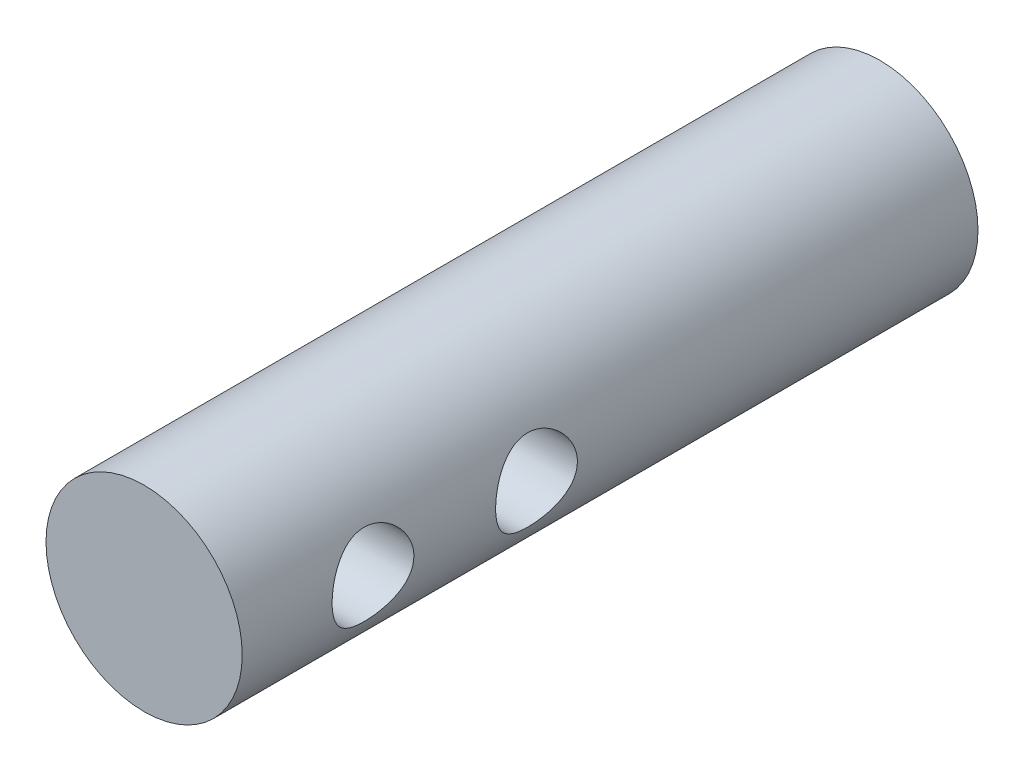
ISO-10303-21;
HEADER;
FILE_DESCRIPTION(('STEP AP214'),'2;1');
FILE_NAME('part.step','',(''),(''),'','','');
FILE_SCHEMA(('AUTOMOTIVE_DESIGN { 1 0 10303 214 1 1 1 1 }'));
ENDSEC;
DATA;
#1=APPLICATION_CONTEXT('core data for automotive mechanical design processes');
#2=APPLICATION_PROTOCOL_DEFINITION('international standard','automotive_design',2000,#1);
#3=PRODUCT_CONTEXT('',#1,'mechanical');
#4=PRODUCT('Part','Part','',(#3));
#5=PRODUCT_RELATED_PRODUCT_CATEGORY('part','',(#4));
#6=PRODUCT_DEFINITION_FORMATION('','',#4);
#7=PRODUCT_DEFINITION_CONTEXT('part definition',#1,'design');
#8=PRODUCT_DEFINITION('design','',#6,#7);
#9=PRODUCT_DEFINITION_SHAPE('','',#8);
#10=(LENGTH_UNIT() NAMED_UNIT(*) SI_UNIT(.MILLI.,.METRE.));
#11=(NAMED_UNIT(*) PLANE_ANGLE_UNIT() SI_UNIT($,.RADIAN.));
#12=(NAMED_UNIT(*) SI_UNIT($,.STERADIAN.) SOLID_ANGLE_UNIT());
#13=UNCERTAINTY_MEASURE_WITH_UNIT(LENGTH_MEASURE(1.E-05),#10,'distance_accuracy_value','');
#14=(GEOMETRIC_REPRESENTATION_CONTEXT(3) GLOBAL_UNCERTAINTY_ASSIGNED_CONTEXT((#13)) GLOBAL_UNIT_ASSIGNED_CONTEXT((#10,
#11,#12)) REPRESENTATION_CONTEXT('',''));
#15=CARTESIAN_POINT('',(0.,0.,0.));
#16=DIRECTION('',(0.,0.,1.));
#17=DIRECTION('',(1.,0.,0.));
#18=AXIS2_PLACEMENT_3D('',#15,#16,#17);
#19=CARTESIAN_POINT('',(0.,0.,21.));
#20=DIRECTION('',(0.,0.,1.));
#21=DIRECTION('',(1.,0.,0.));
#22=AXIS2_PLACEMENT_3D('',#19,#20,#21);
#23=PLANE('',#22);
#24=CARTESIAN_POINT('',(0.,0.,21.));
#25=DIRECTION('',(0.,0.,1.));
#26=DIRECTION('',(1.,0.,0.));
#27=AXIS2_PLACEMENT_3D('',#24,#25,#26);
#28=CIRCLE('',#27,4.05);
#29=CARTESIAN_POINT('',(4.05,0.,21.));
#30=VERTEX_POINT('',#29);
#31=EDGE_CURVE('E17',#30,#30,#28,.F.);
#32=ORIENTED_EDGE('',*,*,#31,.T.);
#33=EDGE_LOOP('',(#32));
#34=FACE_BOUND('',#33,.T.);
#35=ADVANCED_FACE('F14',(#34),#23,.F.);
#36=CARTESIAN_POINT('',(0.,0.,0.));
#37=DIRECTION('',(0.,0.,1.));
#38=DIRECTION('',(1.,0.,0.));
#39=AXIS2_PLACEMENT_3D('',#36,#37,#38);
#40=CYLINDRICAL_SURFACE('',#39,4.05);
#41=CARTESIAN_POINT('',(0.,0.,0.));
#42=DIRECTION('',(0.,0.,1.));
#43=DIRECTION('',(1.,0.,0.));
#44=AXIS2_PLACEMENT_3D('',#41,#42,#43);
#45=CIRCLE('',#44,4.05);
#46=CARTESIAN_POINT('',(4.05,0.,0.));
#47=VERTEX_POINT('',#46);
#48=EDGE_CURVE('E78',#47,#47,#45,.T.);
#49=ORIENTED_EDGE('',*,*,#48,.F.);
#50=EDGE_LOOP('',(#49));
#51=FACE_BOUND('',#50,.T.);
#52=ORIENTED_EDGE('',*,*,#31,.F.);
#53=EDGE_LOOP('',(#52));
#54=FACE_BOUND('',#53,.T.);
#55=ADVANCED_FACE('F66',(#51,#54),#40,.F.);
#56=CARTESIAN_POINT('',(0.,0.,45.));
#57=DIRECTION('',(0.,0.,-1.));
#58=DIRECTION('',(-1.,0.,0.));
#59=AXIS2_PLACEMENT_3D('',#56,#57,#58);
#60=PLANE('',#59);
#61=CARTESIAN_POINT('',(0.,0.,45.));
#62=DIRECTION('',(0.,0.,1.));
#63=DIRECTION('',(1.,0.,0.));
#64=AXIS2_PLACEMENT_3D('',#61,#62,#63);
#65=CIRCLE('',#64,6.);
#66=CARTESIAN_POINT('',(6.,0.,45.));
#67=VERTEX_POINT('',#66);
#68=EDGE_CURVE('E81',#67,#67,#65,.F.);
#69=ORIENTED_EDGE('',*,*,#68,.F.);
#70=EDGE_LOOP('',(#69));
#71=FACE_BOUND('',#70,.T.);
#72=ADVANCED_FACE('F62',(#71),#60,.F.);
#73=CARTESIAN_POINT('',(0.,0.,27.));
#74=DIRECTION('',(1.,0.,0.));
#75=DIRECTION('',(0.,0.,-1.));
#76=AXIS2_PLACEMENT_3D('',#73,#74,#75);
#77=CYLINDRICAL_SURFACE('',#76,2.5);
#78=CARTESIAN_POINT('',(-5.45435605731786,2.5,27.));
#79=CARTESIAN_POINT('',(-5.45435734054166,2.49999850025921,27.0667081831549));
#80=CARTESIAN_POINT('',(-5.4555854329,2.49732449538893,27.1334347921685));
#81=CARTESIAN_POINT('',(-5.460451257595,2.48666416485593,27.266386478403));
#82=CARTESIAN_POINT('',(-5.46409042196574,2.47867468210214,27.3326112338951));
#83=CARTESIAN_POINT('',(-5.47848490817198,2.44679265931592,27.5300518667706));
#84=CARTESIAN_POINT('',(-5.49271671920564,2.41498683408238,27.6598368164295));
#85=CARTESIAN_POINT('',(-5.52853615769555,2.33180001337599,27.9111547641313));
#86=CARTESIAN_POINT('',(-5.55009376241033,2.28049881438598,28.0327190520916));
#87=CARTESIAN_POINT('',(-5.59808356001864,2.16001268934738,28.265510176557));
#88=CARTESIAN_POINT('',(-5.62451459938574,2.09083199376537,28.3767394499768));
#89=CARTESIAN_POINT('',(-5.68111508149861,1.93194778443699,28.5926539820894));
#90=CARTESIAN_POINT('',(-5.71141131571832,1.84130648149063,28.6966157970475));
#91=CARTESIAN_POINT('',(-5.77128595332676,1.64404334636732,28.8883997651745));
#92=CARTESIAN_POINT('',(-5.80086407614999,1.53741538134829,28.9762156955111));
#93=CARTESIAN_POINT('',(-5.8575107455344,1.30552678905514,29.1368992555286));
#94=CARTESIAN_POINT('',(-5.88441479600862,1.17965858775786,29.2089533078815));
#95=CARTESIAN_POINT('',(-5.93113040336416,0.916264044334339,29.3305519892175));
#96=CARTESIAN_POINT('',(-5.95094510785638,0.778742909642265,29.3801066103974));
#97=CARTESIAN_POINT('',(-5.98035041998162,0.503536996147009,29.4526789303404));
#98=CARTESIAN_POINT('',(-5.99041942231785,0.36623315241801,29.4769433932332));
#99=CARTESIAN_POINT('',(-6.00093657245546,0.0891583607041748,29.502275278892));
#100=CARTESIAN_POINT('',(-6.00138862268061,-0.0506115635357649,29.5033521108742));
#101=CARTESIAN_POINT('',(-5.99290258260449,-0.319585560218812,29.4829314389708));
#102=CARTESIAN_POINT('',(-5.98453429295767,-0.448914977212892,29.4628037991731));
#103=CARTESIAN_POINT('',(-5.96013033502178,-0.702165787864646,29.4028937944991));
#104=CARTESIAN_POINT('',(-5.94409410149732,-0.826086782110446,29.3631099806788));
#105=CARTESIAN_POINT('',(-5.90559704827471,-1.06727623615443,29.2645439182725));
#106=CARTESIAN_POINT('',(-5.88304194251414,-1.18441435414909,29.2054810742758));
#107=CARTESIAN_POINT('',(-5.83371427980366,-1.40742353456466,29.0703084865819));
#108=CARTESIAN_POINT('',(-5.80694023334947,-1.51329059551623,28.9941927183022));
#109=CARTESIAN_POINT('',(-5.74963397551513,-1.7186818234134,28.8208351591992));
#110=CARTESIAN_POINT('',(-5.71896988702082,-1.81723287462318,28.722482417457));
#111=CARTESIAN_POINT('',(-5.65875721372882,-1.99686282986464,28.5105771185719));
#112=CARTESIAN_POINT('',(-5.62920906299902,-2.0779349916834,28.3970187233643));
#113=CARTESIAN_POINT('',(-5.57363224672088,-2.22280378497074,28.1532099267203));
#114=CARTESIAN_POINT('',(-5.54775116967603,-2.28594506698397,28.0225335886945));
#115=CARTESIAN_POINT('',(-5.50419688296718,-2.38892864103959,27.7510379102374));
#116=CARTESIAN_POINT('',(-5.48651780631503,-2.42878759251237,27.6102259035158));
#117=CARTESIAN_POINT('',(-5.46282425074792,-2.48160050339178,27.332206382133));
#118=CARTESIAN_POINT('',(-5.45612738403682,-2.49613229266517,27.1953577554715));
#119=CARTESIAN_POINT('',(-5.45320573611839,-2.50251261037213,26.9210430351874));
#120=CARTESIAN_POINT('',(-5.45697733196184,-2.49436898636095,26.7835771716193));
#121=CARTESIAN_POINT('',(-5.47386262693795,-2.45706955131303,26.5212032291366));
#122=CARTESIAN_POINT('',(-5.48636276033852,-2.42929237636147,26.3960546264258));
#123=CARTESIAN_POINT('',(-5.51851260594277,-2.355341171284,26.1522974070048));
#124=CARTESIAN_POINT('',(-5.53816398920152,-2.30916284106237,26.0336903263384));
#125=CARTESIAN_POINT('',(-5.58341595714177,-2.19755041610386,25.8007693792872));
#126=CARTESIAN_POINT('',(-5.60923324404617,-2.13138366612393,25.6868500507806));
#127=CARTESIAN_POINT('',(-5.66360007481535,-1.98240156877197,25.4711838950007));
#128=CARTESIAN_POINT('',(-5.69215079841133,-1.89957901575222,25.3694423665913));
#129=CARTESIAN_POINT('',(-5.75157239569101,-1.71168891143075,25.1723997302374));
#130=CARTESIAN_POINT('',(-5.78244293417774,-1.6053593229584,25.0782972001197));
#131=CARTESIAN_POINT('',(-5.84086722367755,-1.37770302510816,24.9090554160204));
#132=CARTESIAN_POINT('',(-5.868420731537,-1.25637521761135,24.8339175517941));
#133=CARTESIAN_POINT('',(-5.91728503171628,-1.00130936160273,24.7048202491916));
#134=CARTESIAN_POINT('',(-5.93857966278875,-0.867540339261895,24.6509155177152));
#135=CARTESIAN_POINT('',(-5.9723634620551,-0.591717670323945,24.5667664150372));
#136=CARTESIAN_POINT('',(-5.98485787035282,-0.449669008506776,24.536507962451));
#137=CARTESIAN_POINT('',(-5.9990306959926,-0.172033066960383,24.5022837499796));
#138=CARTESIAN_POINT('',(-6.0014040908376,-0.0366881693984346,24.4966280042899));
#139=CARTESIAN_POINT('',(-5.99699046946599,0.232973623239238,24.5072262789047));
#140=CARTESIAN_POINT('',(-5.99020505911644,0.367290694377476,24.523476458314));
#141=CARTESIAN_POINT('',(-5.9686013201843,0.626172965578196,24.5762121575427));
#142=CARTESIAN_POINT('',(-5.95407648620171,0.750915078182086,24.6119594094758));
#143=CARTESIAN_POINT('',(-5.91858999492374,0.992584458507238,24.7018684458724));
#144=CARTESIAN_POINT('',(-5.8976271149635,1.1095102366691,24.7560337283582));
#145=CARTESIAN_POINT('',(-5.85011651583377,1.33804914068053,24.8839792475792));
#146=CARTESIAN_POINT('',(-5.82335921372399,1.44918335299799,24.958535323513));
#147=CARTESIAN_POINT('',(-5.7674312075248,1.65783731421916,25.1240136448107));
#148=CARTESIAN_POINT('',(-5.73825960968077,1.75535198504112,25.2149419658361));
#149=CARTESIAN_POINT('',(-5.67829702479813,1.9408997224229,25.4178925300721));
#150=CARTESIAN_POINT('',(-5.64753091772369,2.02783607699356,25.5309291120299));
#151=CARTESIAN_POINT('',(-5.5899105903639,2.18166607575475,25.7709063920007));
#152=CARTESIAN_POINT('',(-5.56305856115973,2.24854851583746,25.8978548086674));
#153=CARTESIAN_POINT('',(-5.51685287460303,2.35965744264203,26.1619289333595));
#154=CARTESIAN_POINT('',(-5.49745949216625,2.40400437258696,26.2989959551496));
#155=CARTESIAN_POINT('',(-5.47594959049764,2.45239925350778,26.5091637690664));
#156=CARTESIAN_POINT('',(-5.47004503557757,2.46550603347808,26.5799105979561));
#157=CARTESIAN_POINT('',(-5.46095373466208,2.48558130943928,26.7224260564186));
#158=CARTESIAN_POINT('',(-5.45776506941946,2.49255414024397,26.7941939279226));
#159=CARTESIAN_POINT('',(-5.45490391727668,2.49880479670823,26.910711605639));
#160=CARTESIAN_POINT('',(-5.45435519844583,2.50000100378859,26.9553516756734));
#161=CARTESIAN_POINT('',(-5.45435605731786,2.5,27.));
#162=B_SPLINE_CURVE_WITH_KNOTS('',3,(#78,#79,#80,#81,#82,#83,#84,#85,#86,#87,#88,#89,#90,#91,
#92,#93,#94,#95,#96,#97,#98,#99,#100,#101,#102,#103,#104,#105,#106,#107,#108,#109,#110,#111,
#112,#113,#114,#115,#116,#117,#118,#119,#120,#121,#122,#123,#124,#125,#126,#127,#128,#129,#130,
#131,#132,#133,#134,#135,#136,#137,#138,#139,#140,#141,#142,#143,#144,#145,#146,#147,#148,#149,
#150,#151,#152,#153,#154,#155,#156,#157,#158,#159,#160,#161),.UNSPECIFIED.,.T.,.F.,(4,2,2,2,2,2,
2,2,2,2,2,2,2,2,2,2,2,2,2,2,2,2,2,2,2,2,2,2,2,2,2,2,2,2,2,2,2,2,2,2,2,4),(0.,0.200084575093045,
0.400288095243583,0.801278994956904,1.20064597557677,1.59991854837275,2.02172149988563,
2.44368668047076,2.88395420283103,3.32402600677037,3.7411967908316,4.15819828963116,
4.54982147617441,4.94147353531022,5.33910096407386,5.73686909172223,6.16267530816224,
6.58864548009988,7.02861558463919,7.46827048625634,7.87940023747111,8.29038772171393,
8.6750626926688,9.05982760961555,9.46088720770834,9.86212068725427,10.2960179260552,
10.7299469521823,11.1649867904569,11.5997673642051,12.004157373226,12.4084764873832,
12.7984529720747,13.1885035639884,13.5961819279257,14.0040118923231,14.4395932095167,
14.8754174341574,15.3088871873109,15.5252058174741,15.7413714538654,15.8752896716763),.UNSPECIFIED.);
#163=CARTESIAN_POINT('',(-5.45435605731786,2.5,27.));
#164=VERTEX_POINT('',#163);
#165=EDGE_CURVE('E54',#164,#164,#162,.T.);
#166=ORIENTED_EDGE('',*,*,#165,.F.);
#167=EDGE_LOOP('',(#166));
#168=FACE_BOUND('',#167,.T.);
#169=CARTESIAN_POINT('',(5.45435605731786,2.5,27.));
#170=CARTESIAN_POINT('',(5.45435734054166,2.49999850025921,26.9332918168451));
#171=CARTESIAN_POINT('',(5.4555854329,2.49732449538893,26.8665652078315));
#172=CARTESIAN_POINT('',(5.460451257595,2.48666416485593,26.733613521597));
#173=CARTESIAN_POINT('',(5.46409042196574,2.47867468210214,26.6673887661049));
#174=CARTESIAN_POINT('',(5.47848490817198,2.44679265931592,26.4699481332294));
#175=CARTESIAN_POINT('',(5.49271671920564,2.41498683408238,26.3401631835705));
#176=CARTESIAN_POINT('',(5.52853615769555,2.33180001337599,26.0888452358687));
#177=CARTESIAN_POINT('',(5.55009376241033,2.28049881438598,25.9672809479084));
#178=CARTESIAN_POINT('',(5.59808356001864,2.16001268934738,25.734489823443));
#179=CARTESIAN_POINT('',(5.62451459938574,2.09083199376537,25.6232605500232));
#180=CARTESIAN_POINT('',(5.68111508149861,1.93194778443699,25.4073460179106));
#181=CARTESIAN_POINT('',(5.71141131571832,1.84130648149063,25.3033842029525));
#182=CARTESIAN_POINT('',(5.77128595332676,1.64404334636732,25.1116002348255));
#183=CARTESIAN_POINT('',(5.80086407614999,1.53741538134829,25.0237843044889));
#184=CARTESIAN_POINT('',(5.8575107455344,1.30552678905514,24.8631007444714));
#185=CARTESIAN_POINT('',(5.88441479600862,1.17965858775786,24.7910466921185));
#186=CARTESIAN_POINT('',(5.93113040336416,0.91626404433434,24.6694480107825));
#187=CARTESIAN_POINT('',(5.95094510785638,0.778742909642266,24.6198933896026));
#188=CARTESIAN_POINT('',(5.98035041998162,0.503536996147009,24.5473210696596));
#189=CARTESIAN_POINT('',(5.99041942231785,0.36623315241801,24.5230566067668));
#190=CARTESIAN_POINT('',(6.00093657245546,0.0891583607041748,24.497724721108));
#191=CARTESIAN_POINT('',(6.00138862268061,-0.050611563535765,24.4966478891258));
#192=CARTESIAN_POINT('',(5.99290258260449,-0.319585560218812,24.5170685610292));
#193=CARTESIAN_POINT('',(5.98453429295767,-0.448914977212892,24.5371962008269));
#194=CARTESIAN_POINT('',(5.96013033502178,-0.702165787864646,24.5971062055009));
#195=CARTESIAN_POINT('',(5.94409410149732,-0.826086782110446,24.6368900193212));
#196=CARTESIAN_POINT('',(5.90559704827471,-1.06727623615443,24.7354560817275));
#197=CARTESIAN_POINT('',(5.88304194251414,-1.18441435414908,24.7945189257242));
#198=CARTESIAN_POINT('',(5.83371427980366,-1.40742353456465,24.9296915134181));
#199=CARTESIAN_POINT('',(5.80694023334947,-1.51329059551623,25.0058072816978));
#200=CARTESIAN_POINT('',(5.74963397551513,-1.7186818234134,25.1791648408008));
#201=CARTESIAN_POINT('',(5.71896988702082,-1.81723287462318,25.277517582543));
#202=CARTESIAN_POINT('',(5.65875721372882,-1.99686282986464,25.4894228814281));
#203=CARTESIAN_POINT('',(5.62920906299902,-2.07793499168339,25.6029812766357));
#204=CARTESIAN_POINT('',(5.57363224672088,-2.22280378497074,25.8467900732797));
#205=CARTESIAN_POINT('',(5.54775116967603,-2.28594506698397,25.9774664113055));
#206=CARTESIAN_POINT('',(5.50419688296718,-2.38892864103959,26.2489620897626));
#207=CARTESIAN_POINT('',(5.48651780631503,-2.42878759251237,26.3897740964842));
#208=CARTESIAN_POINT('',(5.46282425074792,-2.48160050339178,26.667793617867));
#209=CARTESIAN_POINT('',(5.45612738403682,-2.49613229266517,26.8046422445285));
#210=CARTESIAN_POINT('',(5.45320573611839,-2.50251261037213,27.0789569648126));
#211=CARTESIAN_POINT('',(5.45697733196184,-2.49436898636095,27.2164228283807));
#212=CARTESIAN_POINT('',(5.47386262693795,-2.45706955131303,27.4787967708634));
#213=CARTESIAN_POINT('',(5.48636276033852,-2.42929237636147,27.6039453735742));
#214=CARTESIAN_POINT('',(5.51851260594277,-2.355341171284,27.8477025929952));
#215=CARTESIAN_POINT('',(5.53816398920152,-2.30916284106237,27.9663096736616));
#216=CARTESIAN_POINT('',(5.58341595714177,-2.19755041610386,28.1992306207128));
#217=CARTESIAN_POINT('',(5.60923324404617,-2.13138366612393,28.3131499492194));
#218=CARTESIAN_POINT('',(5.66360007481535,-1.98240156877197,28.5288161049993));
#219=CARTESIAN_POINT('',(5.69215079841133,-1.89957901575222,28.6305576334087));
#220=CARTESIAN_POINT('',(5.75157239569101,-1.71168891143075,28.8276002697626));
#221=CARTESIAN_POINT('',(5.78244293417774,-1.6053593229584,28.9217027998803));
#222=CARTESIAN_POINT('',(5.84086722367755,-1.37770302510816,29.0909445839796));
#223=CARTESIAN_POINT('',(5.868420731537,-1.25637521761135,29.1660824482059));
#224=CARTESIAN_POINT('',(5.91728503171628,-1.00130936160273,29.2951797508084));
#225=CARTESIAN_POINT('',(5.93857966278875,-0.867540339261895,29.3490844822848));
#226=CARTESIAN_POINT('',(5.9723634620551,-0.591717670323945,29.4332335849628));
#227=CARTESIAN_POINT('',(5.98485787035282,-0.449669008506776,29.463492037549));
#228=CARTESIAN_POINT('',(5.9990306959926,-0.172033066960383,29.4977162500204));
#229=CARTESIAN_POINT('',(6.0014040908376,-0.0366881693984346,29.5033719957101));
#230=CARTESIAN_POINT('',(5.99699046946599,0.232973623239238,29.4927737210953));
#231=CARTESIAN_POINT('',(5.99020505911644,0.367290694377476,29.476523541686));
#232=CARTESIAN_POINT('',(5.9686013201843,0.626172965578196,29.4237878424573));
#233=CARTESIAN_POINT('',(5.95407648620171,0.750915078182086,29.3880405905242));
#234=CARTESIAN_POINT('',(5.91858999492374,0.992584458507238,29.2981315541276));
#235=CARTESIAN_POINT('',(5.8976271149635,1.1095102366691,29.2439662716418));
#236=CARTESIAN_POINT('',(5.85011651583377,1.33804914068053,29.1160207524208));
#237=CARTESIAN_POINT('',(5.82335921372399,1.44918335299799,29.0414646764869));
#238=CARTESIAN_POINT('',(5.7674312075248,1.65783731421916,28.8759863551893));
#239=CARTESIAN_POINT('',(5.73825960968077,1.75535198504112,28.7850580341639));
#240=CARTESIAN_POINT('',(5.67829702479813,1.9408997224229,28.5821074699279));
#241=CARTESIAN_POINT('',(5.64753091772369,2.02783607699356,28.4690708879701));
#242=CARTESIAN_POINT('',(5.5899105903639,2.18166607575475,28.2290936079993));
#243=CARTESIAN_POINT('',(5.56305856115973,2.24854851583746,28.1021451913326));
#244=CARTESIAN_POINT('',(5.51685287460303,2.35965744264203,27.8380710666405));
#245=CARTESIAN_POINT('',(5.49745949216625,2.40400437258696,27.7010040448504));
#246=CARTESIAN_POINT('',(5.47594959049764,2.45239925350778,27.4908362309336));
#247=CARTESIAN_POINT('',(5.47004503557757,2.46550603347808,27.4200894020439));
#248=CARTESIAN_POINT('',(5.46095373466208,2.48558130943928,27.2775739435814));
#249=CARTESIAN_POINT('',(5.45776506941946,2.49255414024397,27.2058060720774));
#250=CARTESIAN_POINT('',(5.45490391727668,2.49880479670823,27.089288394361));
#251=CARTESIAN_POINT('',(5.45435519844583,2.50000100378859,27.0446483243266));
#252=CARTESIAN_POINT('',(5.45435605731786,2.5,27.));
#253=B_SPLINE_CURVE_WITH_KNOTS('',3,(#169,#170,#171,#172,#173,#174,#175,#176,#177,#178,#179,
#180,#181,#182,#183,#184,#185,#186,#187,#188,#189,#190,#191,#192,#193,#194,#195,#196,#197,#198,
#199,#200,#201,#202,#203,#204,#205,#206,#207,#208,#209,#210,#211,#212,#213,#214,#215,#216,#217,
#218,#219,#220,#221,#222,#223,#224,#225,#226,#227,#228,#229,#230,#231,#232,#233,#234,#235,#236,
#237,#238,#239,#240,#241,#242,#243,#244,#245,#246,#247,#248,#249,#250,#251,#252),.UNSPECIFIED.,
.T.,.F.,(4,2,2,2,2,2,2,2,2,2,2,2,2,2,2,2,2,2,2,2,2,2,2,2,2,2,2,2,2,2,2,2,2,2,2,2,2,2,2,2,2,4),
(0.,0.200084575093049,0.400288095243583,0.801278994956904,1.20064597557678,1.59991854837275,
2.02172149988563,2.44368668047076,2.88395420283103,3.32402600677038,3.7411967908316,
4.15819828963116,4.54982147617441,4.94147353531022,5.33910096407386,5.73686909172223,
6.16267530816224,6.58864548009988,7.02861558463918,7.46827048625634,7.87940023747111,
8.29038772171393,8.6750626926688,9.05982760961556,9.46088720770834,9.86212068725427,
10.2960179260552,10.7299469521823,11.1649867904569,11.5997673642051,12.004157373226,
12.4084764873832,12.7984529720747,13.1885035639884,13.5961819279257,14.0040118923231,
14.4395932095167,14.8754174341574,15.3088871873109,15.5252058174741,15.7413714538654,
15.8752896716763),.UNSPECIFIED.);
#254=CARTESIAN_POINT('',(5.45435605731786,2.5,27.));
#255=VERTEX_POINT('',#254);
#256=EDGE_CURVE('E49',#255,#255,#253,.T.);
#257=ORIENTED_EDGE('',*,*,#256,.F.);
#258=EDGE_LOOP('',(#257));
#259=FACE_BOUND('',#258,.T.);
#260=ADVANCED_FACE('F58',(#168,#259),#77,.F.);
#261=CARTESIAN_POINT('',(0.,0.,37.));
#262=DIRECTION('',(1.,0.,0.));
#263=DIRECTION('',(0.,0.,-1.));
#264=AXIS2_PLACEMENT_3D('',#261,#262,#263);
#265=CYLINDRICAL_SURFACE('',#264,2.5);
#266=CARTESIAN_POINT('',(-5.45435605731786,2.5,37.));
#267=CARTESIAN_POINT('',(-5.45435734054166,2.49999850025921,37.0667081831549));
#268=CARTESIAN_POINT('',(-5.4555854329,2.49732449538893,37.1334347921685));
#269=CARTESIAN_POINT('',(-5.460451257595,2.48666416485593,37.266386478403));
#270=CARTESIAN_POINT('',(-5.46409042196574,2.47867468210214,37.3326112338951));
#271=CARTESIAN_POINT('',(-5.47848490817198,2.44679265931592,37.5300518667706));
#272=CARTESIAN_POINT('',(-5.49271671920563,2.41498683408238,37.6598368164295));
#273=CARTESIAN_POINT('',(-5.52853615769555,2.33180001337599,37.9111547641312));
#274=CARTESIAN_POINT('',(-5.55009376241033,2.28049881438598,38.0327190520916));
#275=CARTESIAN_POINT('',(-5.59808356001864,2.16001268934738,38.265510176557));
#276=CARTESIAN_POINT('',(-5.62451459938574,2.09083199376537,38.3767394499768));
#277=CARTESIAN_POINT('',(-5.68111508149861,1.93194778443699,38.5926539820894));
#278=CARTESIAN_POINT('',(-5.71141131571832,1.84130648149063,38.6966157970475));
#279=CARTESIAN_POINT('',(-5.77128595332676,1.64404334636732,38.8883997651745));
#280=CARTESIAN_POINT('',(-5.80086407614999,1.53741538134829,38.9762156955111));
#281=CARTESIAN_POINT('',(-5.8575107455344,1.30552678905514,39.1368992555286));
#282=CARTESIAN_POINT('',(-5.88441479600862,1.17965858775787,39.2089533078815));
#283=CARTESIAN_POINT('',(-5.93113040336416,0.916264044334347,39.3305519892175));
#284=CARTESIAN_POINT('',(-5.95094510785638,0.778742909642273,39.3801066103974));
#285=CARTESIAN_POINT('',(-5.98035041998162,0.503536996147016,39.4526789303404));
#286=CARTESIAN_POINT('',(-5.99041942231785,0.366233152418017,39.4769433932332));
#287=CARTESIAN_POINT('',(-6.00093657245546,0.08915836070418,39.502275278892));
#288=CARTESIAN_POINT('',(-6.00138862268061,-0.0506115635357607,39.5033521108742));
#289=CARTESIAN_POINT('',(-5.99290258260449,-0.319585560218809,39.4829314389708));
#290=CARTESIAN_POINT('',(-5.98453429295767,-0.448914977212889,39.4628037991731));
#291=CARTESIAN_POINT('',(-5.96013033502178,-0.702165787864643,39.4028937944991));
#292=CARTESIAN_POINT('',(-5.94409410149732,-0.826086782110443,39.3631099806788));
#293=CARTESIAN_POINT('',(-5.90559704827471,-1.06727623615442,39.2645439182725));
#294=CARTESIAN_POINT('',(-5.88304194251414,-1.18441435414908,39.2054810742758));
#295=CARTESIAN_POINT('',(-5.83371427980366,-1.40742353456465,39.0703084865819));
#296=CARTESIAN_POINT('',(-5.80694023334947,-1.51329059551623,38.9941927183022));
#297=CARTESIAN_POINT('',(-5.74963397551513,-1.7186818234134,38.8208351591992));
#298=CARTESIAN_POINT('',(-5.71896988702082,-1.81723287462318,38.722482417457));
#299=CARTESIAN_POINT('',(-5.65875721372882,-1.99686282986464,38.5105771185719));
#300=CARTESIAN_POINT('',(-5.62920906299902,-2.07793499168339,38.3970187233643));
#301=CARTESIAN_POINT('',(-5.57363224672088,-2.22280378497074,38.1532099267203));
#302=CARTESIAN_POINT('',(-5.54775116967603,-2.28594506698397,38.0225335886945));
#303=CARTESIAN_POINT('',(-5.50419688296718,-2.38892864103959,37.7510379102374));
#304=CARTESIAN_POINT('',(-5.48651780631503,-2.42878759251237,37.6102259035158));
#305=CARTESIAN_POINT('',(-5.46282425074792,-2.48160050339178,37.332206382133));
#306=CARTESIAN_POINT('',(-5.45612738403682,-2.49613229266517,37.1953577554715));
#307=CARTESIAN_POINT('',(-5.45320573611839,-2.50251261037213,36.9210430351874));
#308=CARTESIAN_POINT('',(-5.45697733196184,-2.49436898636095,36.7835771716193));
#309=CARTESIAN_POINT('',(-5.47386262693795,-2.45706955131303,36.5212032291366));
#310=CARTESIAN_POINT('',(-5.48636276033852,-2.42929237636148,36.3960546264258));
#311=CARTESIAN_POINT('',(-5.51851260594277,-2.355341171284,36.1522974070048));
#312=CARTESIAN_POINT('',(-5.53816398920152,-2.30916284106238,36.0336903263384));
#313=CARTESIAN_POINT('',(-5.58341595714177,-2.19755041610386,35.8007693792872));
#314=CARTESIAN_POINT('',(-5.60923324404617,-2.13138366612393,35.6868500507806));
#315=CARTESIAN_POINT('',(-5.66360007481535,-1.98240156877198,35.4711838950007));
#316=CARTESIAN_POINT('',(-5.69215079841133,-1.89957901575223,35.3694423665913));
#317=CARTESIAN_POINT('',(-5.75157239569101,-1.71168891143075,35.1723997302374));
#318=CARTESIAN_POINT('',(-5.78244293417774,-1.60535932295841,35.0782972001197));
#319=CARTESIAN_POINT('',(-5.84086722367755,-1.37770302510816,34.9090554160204));
#320=CARTESIAN_POINT('',(-5.868420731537,-1.25637521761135,34.8339175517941));
#321=CARTESIAN_POINT('',(-5.91728503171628,-1.00130936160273,34.7048202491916));
#322=CARTESIAN_POINT('',(-5.93857966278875,-0.867540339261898,34.6509155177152));
#323=CARTESIAN_POINT('',(-5.9723634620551,-0.591717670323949,34.5667664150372));
#324=CARTESIAN_POINT('',(-5.98485787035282,-0.449669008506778,34.536507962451));
#325=CARTESIAN_POINT('',(-5.9990306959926,-0.172033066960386,34.5022837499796));
#326=CARTESIAN_POINT('',(-6.0014040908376,-0.0366881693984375,34.4966280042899));
#327=CARTESIAN_POINT('',(-5.99699046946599,0.232973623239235,34.5072262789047));
#328=CARTESIAN_POINT('',(-5.99020505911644,0.367290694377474,34.5234764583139));
#329=CARTESIAN_POINT('',(-5.9686013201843,0.626172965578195,34.5762121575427));
#330=CARTESIAN_POINT('',(-5.95407648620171,0.750915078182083,34.6119594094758));
#331=CARTESIAN_POINT('',(-5.91858999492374,0.992584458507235,34.7018684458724));
#332=CARTESIAN_POINT('',(-5.8976271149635,1.1095102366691,34.7560337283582));
#333=CARTESIAN_POINT('',(-5.85011651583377,1.33804914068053,34.8839792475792));
#334=CARTESIAN_POINT('',(-5.82335921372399,1.44918335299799,34.958535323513));
#335=CARTESIAN_POINT('',(-5.7674312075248,1.65783731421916,35.1240136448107));
#336=CARTESIAN_POINT('',(-5.73825960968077,1.75535198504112,35.2149419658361));
#337=CARTESIAN_POINT('',(-5.67829702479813,1.9408997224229,35.4178925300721));
#338=CARTESIAN_POINT('',(-5.64753091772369,2.02783607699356,35.5309291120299));
#339=CARTESIAN_POINT('',(-5.5899105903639,2.18166607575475,35.7709063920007));
#340=CARTESIAN_POINT('',(-5.56305856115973,2.24854851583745,35.8978548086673));
#341=CARTESIAN_POINT('',(-5.51685287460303,2.35965744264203,36.1619289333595));
#342=CARTESIAN_POINT('',(-5.49745949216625,2.40400437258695,36.2989959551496));
#343=CARTESIAN_POINT('',(-5.47594959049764,2.45239925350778,36.5091637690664));
#344=CARTESIAN_POINT('',(-5.47004503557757,2.46550603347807,36.579910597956));
#345=CARTESIAN_POINT('',(-5.46095373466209,2.48558130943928,36.7224260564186));
#346=CARTESIAN_POINT('',(-5.45776506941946,2.49255414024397,36.7941939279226));
#347=CARTESIAN_POINT('',(-5.45490391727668,2.49880479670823,36.910711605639));
#348=CARTESIAN_POINT('',(-5.45435519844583,2.50000100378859,36.9553516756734));
#349=CARTESIAN_POINT('',(-5.45435605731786,2.5,37.));
#350=B_SPLINE_CURVE_WITH_KNOTS('',3,(#266,#267,#268,#269,#270,#271,#272,#273,#274,#275,#276,
#277,#278,#279,#280,#281,#282,#283,#284,#285,#286,#287,#288,#289,#290,#291,#292,#293,#294,#295,
#296,#297,#298,#299,#300,#301,#302,#303,#304,#305,#306,#307,#308,#309,#310,#311,#312,#313,#314,
#315,#316,#317,#318,#319,#320,#321,#322,#323,#324,#325,#326,#327,#328,#329,#330,#331,#332,#333,
#334,#335,#336,#337,#338,#339,#340,#341,#342,#343,#344,#345,#346,#347,#348,#349),.UNSPECIFIED.,
.T.,.F.,(4,2,2,2,2,2,2,2,2,2,2,2,2,2,2,2,2,2,2,2,2,2,2,2,2,2,2,2,2,2,2,2,2,2,2,2,2,2,2,2,2,4),
(0.,0.200084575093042,0.400288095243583,0.8012789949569,1.20064597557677,1.59991854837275,
2.02172149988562,2.44368668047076,2.88395420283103,3.32402600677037,3.74119679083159,
4.15819828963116,4.54982147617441,4.94147353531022,5.33910096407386,5.73686909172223,
6.16267530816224,6.58864548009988,7.02861558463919,7.46827048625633,7.8794002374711,
8.29038772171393,8.6750626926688,9.05982760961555,9.46088720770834,9.86212068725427,
10.2960179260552,10.7299469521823,11.1649867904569,11.5997673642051,12.004157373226,
12.4084764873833,12.7984529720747,13.1885035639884,13.5961819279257,14.0040118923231,
14.4395932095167,14.8754174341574,15.3088871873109,15.5252058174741,15.7413714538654,
15.8752896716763),.UNSPECIFIED.);
#351=CARTESIAN_POINT('',(-5.45435605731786,2.5,37.));
#352=VERTEX_POINT('',#351);
#353=EDGE_CURVE('E22',#352,#352,#350,.T.);
#354=ORIENTED_EDGE('',*,*,#353,.F.);
#355=EDGE_LOOP('',(#354));
#356=FACE_BOUND('',#355,.T.);
#357=CARTESIAN_POINT('',(5.45435605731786,2.5,37.));
#358=CARTESIAN_POINT('',(5.45435734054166,2.49999850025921,36.9332918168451));
#359=CARTESIAN_POINT('',(5.4555854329,2.49732449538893,36.8665652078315));
#360=CARTESIAN_POINT('',(5.460451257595,2.48666416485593,36.733613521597));
#361=CARTESIAN_POINT('',(5.46409042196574,2.47867468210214,36.6673887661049));
#362=CARTESIAN_POINT('',(5.47848490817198,2.44679265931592,36.4699481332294));
#363=CARTESIAN_POINT('',(5.49271671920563,2.41498683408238,36.3401631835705));
#364=CARTESIAN_POINT('',(5.52853615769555,2.33180001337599,36.0888452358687));
#365=CARTESIAN_POINT('',(5.55009376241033,2.28049881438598,35.9672809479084));
#366=CARTESIAN_POINT('',(5.59808356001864,2.16001268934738,35.734489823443));
#367=CARTESIAN_POINT('',(5.62451459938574,2.09083199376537,35.6232605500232));
#368=CARTESIAN_POINT('',(5.68111508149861,1.93194778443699,35.4073460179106));
#369=CARTESIAN_POINT('',(5.71141131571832,1.84130648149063,35.3033842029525));
#370=CARTESIAN_POINT('',(5.77128595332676,1.64404334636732,35.1116002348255));
#371=CARTESIAN_POINT('',(5.80086407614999,1.53741538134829,35.0237843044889));
#372=CARTESIAN_POINT('',(5.8575107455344,1.30552678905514,34.8631007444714));
#373=CARTESIAN_POINT('',(5.88441479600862,1.17965858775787,34.7910466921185));
#374=CARTESIAN_POINT('',(5.93113040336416,0.916264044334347,34.6694480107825));
#375=CARTESIAN_POINT('',(5.95094510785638,0.778742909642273,34.6198933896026));
#376=CARTESIAN_POINT('',(5.98035041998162,0.503536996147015,34.5473210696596));
#377=CARTESIAN_POINT('',(5.99041942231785,0.366233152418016,34.5230566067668));
#378=CARTESIAN_POINT('',(6.00093657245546,0.0891583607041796,34.497724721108));
#379=CARTESIAN_POINT('',(6.00138862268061,-0.0506115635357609,34.4966478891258));
#380=CARTESIAN_POINT('',(5.99290258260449,-0.319585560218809,34.5170685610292));
#381=CARTESIAN_POINT('',(5.98453429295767,-0.448914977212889,34.5371962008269));
#382=CARTESIAN_POINT('',(5.96013033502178,-0.702165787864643,34.5971062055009));
#383=CARTESIAN_POINT('',(5.94409410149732,-0.826086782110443,34.6368900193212));
#384=CARTESIAN_POINT('',(5.90559704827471,-1.06727623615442,34.7354560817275));
#385=CARTESIAN_POINT('',(5.88304194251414,-1.18441435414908,34.7945189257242));
#386=CARTESIAN_POINT('',(5.83371427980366,-1.40742353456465,34.9296915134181));
#387=CARTESIAN_POINT('',(5.80694023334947,-1.51329059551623,35.0058072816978));
#388=CARTESIAN_POINT('',(5.74963397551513,-1.7186818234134,35.1791648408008));
#389=CARTESIAN_POINT('',(5.71896988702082,-1.81723287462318,35.277517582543));
#390=CARTESIAN_POINT('',(5.65875721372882,-1.99686282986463,35.4894228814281));
#391=CARTESIAN_POINT('',(5.62920906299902,-2.07793499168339,35.6029812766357));
#392=CARTESIAN_POINT('',(5.57363224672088,-2.22280378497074,35.8467900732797));
#393=CARTESIAN_POINT('',(5.54775116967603,-2.28594506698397,35.9774664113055));
#394=CARTESIAN_POINT('',(5.50419688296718,-2.38892864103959,36.2489620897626));
#395=CARTESIAN_POINT('',(5.48651780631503,-2.42878759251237,36.3897740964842));
#396=CARTESIAN_POINT('',(5.46282425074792,-2.48160050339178,36.667793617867));
#397=CARTESIAN_POINT('',(5.45612738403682,-2.49613229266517,36.8046422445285));
#398=CARTESIAN_POINT('',(5.45320573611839,-2.50251261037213,37.0789569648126));
#399=CARTESIAN_POINT('',(5.45697733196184,-2.49436898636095,37.2164228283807));
#400=CARTESIAN_POINT('',(5.47386262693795,-2.45706955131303,37.4787967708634));
#401=CARTESIAN_POINT('',(5.48636276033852,-2.42929237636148,37.6039453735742));
#402=CARTESIAN_POINT('',(5.51851260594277,-2.355341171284,37.8477025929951));
#403=CARTESIAN_POINT('',(5.53816398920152,-2.30916284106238,37.9663096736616));
#404=CARTESIAN_POINT('',(5.58341595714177,-2.19755041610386,38.1992306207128));
#405=CARTESIAN_POINT('',(5.60923324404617,-2.13138366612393,38.3131499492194));
#406=CARTESIAN_POINT('',(5.66360007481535,-1.98240156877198,38.5288161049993));
#407=CARTESIAN_POINT('',(5.69215079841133,-1.89957901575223,38.6305576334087));
#408=CARTESIAN_POINT('',(5.75157239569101,-1.71168891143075,38.8276002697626));
#409=CARTESIAN_POINT('',(5.78244293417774,-1.60535932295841,38.9217027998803));
#410=CARTESIAN_POINT('',(5.84086722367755,-1.37770302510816,39.0909445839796));
#411=CARTESIAN_POINT('',(5.868420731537,-1.25637521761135,39.1660824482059));
#412=CARTESIAN_POINT('',(5.91728503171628,-1.00130936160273,39.2951797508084));
#413=CARTESIAN_POINT('',(5.93857966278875,-0.867540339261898,39.3490844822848));
#414=CARTESIAN_POINT('',(5.9723634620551,-0.591717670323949,39.4332335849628));
#415=CARTESIAN_POINT('',(5.98485787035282,-0.449669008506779,39.463492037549));
#416=CARTESIAN_POINT('',(5.9990306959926,-0.172033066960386,39.4977162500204));
#417=CARTESIAN_POINT('',(6.0014040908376,-0.0366881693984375,39.5033719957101));
#418=CARTESIAN_POINT('',(5.99699046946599,0.232973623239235,39.4927737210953));
#419=CARTESIAN_POINT('',(5.99020505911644,0.367290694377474,39.476523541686));
#420=CARTESIAN_POINT('',(5.9686013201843,0.626172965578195,39.4237878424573));
#421=CARTESIAN_POINT('',(5.95407648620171,0.750915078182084,39.3880405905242));
#422=CARTESIAN_POINT('',(5.91858999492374,0.992584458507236,39.2981315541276));
#423=CARTESIAN_POINT('',(5.8976271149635,1.1095102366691,39.2439662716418));
#424=CARTESIAN_POINT('',(5.85011651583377,1.33804914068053,39.1160207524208));
#425=CARTESIAN_POINT('',(5.82335921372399,1.44918335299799,39.0414646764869));
#426=CARTESIAN_POINT('',(5.7674312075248,1.65783731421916,38.8759863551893));
#427=CARTESIAN_POINT('',(5.73825960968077,1.75535198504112,38.7850580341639));
#428=CARTESIAN_POINT('',(5.67829702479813,1.9408997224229,38.5821074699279));
#429=CARTESIAN_POINT('',(5.64753091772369,2.02783607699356,38.4690708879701));
#430=CARTESIAN_POINT('',(5.5899105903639,2.18166607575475,38.2290936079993));
#431=CARTESIAN_POINT('',(5.56305856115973,2.24854851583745,38.1021451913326));
#432=CARTESIAN_POINT('',(5.51685287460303,2.35965744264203,37.8380710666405));
#433=CARTESIAN_POINT('',(5.49745949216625,2.40400437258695,37.7010040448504));
#434=CARTESIAN_POINT('',(5.47594959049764,2.45239925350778,37.4908362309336));
#435=CARTESIAN_POINT('',(5.47004503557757,2.46550603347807,37.420089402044));
#436=CARTESIAN_POINT('',(5.46095373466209,2.48558130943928,37.2775739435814));
#437=CARTESIAN_POINT('',(5.45776506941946,2.49255414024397,37.2058060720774));
#438=CARTESIAN_POINT('',(5.45490391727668,2.49880479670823,37.089288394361));
#439=CARTESIAN_POINT('',(5.45435519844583,2.50000100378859,37.0446483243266));
#440=CARTESIAN_POINT('',(5.45435605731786,2.5,37.));
#441=B_SPLINE_CURVE_WITH_KNOTS('',3,(#357,#358,#359,#360,#361,#362,#363,#364,#365,#366,#367,
#368,#369,#370,#371,#372,#373,#374,#375,#376,#377,#378,#379,#380,#381,#382,#383,#384,#385,#386,
#387,#388,#389,#390,#391,#392,#393,#394,#395,#396,#397,#398,#399,#400,#401,#402,#403,#404,#405,
#406,#407,#408,#409,#410,#411,#412,#413,#414,#415,#416,#417,#418,#419,#420,#421,#422,#423,#424,
#425,#426,#427,#428,#429,#430,#431,#432,#433,#434,#435,#436,#437,#438,#439,#440),.UNSPECIFIED.,
.T.,.F.,(4,2,2,2,2,2,2,2,2,2,2,2,2,2,2,2,2,2,2,2,2,2,2,2,2,2,2,2,2,2,2,2,2,2,2,2,2,2,2,2,2,4),
(0.,0.200084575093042,0.400288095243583,0.8012789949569,1.20064597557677,1.59991854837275,
2.02172149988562,2.44368668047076,2.88395420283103,3.32402600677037,3.74119679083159,
4.15819828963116,4.54982147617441,4.94147353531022,5.33910096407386,5.73686909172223,
6.16267530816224,6.58864548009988,7.02861558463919,7.46827048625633,7.8794002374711,
8.29038772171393,8.6750626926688,9.05982760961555,9.46088720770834,9.86212068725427,
10.2960179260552,10.7299469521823,11.1649867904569,11.5997673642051,12.004157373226,
12.4084764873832,12.7984529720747,13.1885035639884,13.5961819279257,14.004011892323,
14.4395932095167,14.8754174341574,15.3088871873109,15.5252058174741,15.7413714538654,
15.8752896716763),.UNSPECIFIED.);
#442=CARTESIAN_POINT('',(5.45435605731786,2.5,37.));
#443=VERTEX_POINT('',#442);
#444=EDGE_CURVE('E28',#443,#443,#441,.T.);
#445=ORIENTED_EDGE('',*,*,#444,.F.);
#446=EDGE_LOOP('',(#445));
#447=FACE_BOUND('',#446,.T.);
#448=ADVANCED_FACE('F38',(#356,#447),#265,.F.);
#449=CARTESIAN_POINT('',(0.,0.,0.));
#450=DIRECTION('',(0.,0.,-1.));
#451=DIRECTION('',(-1.,0.,0.));
#452=AXIS2_PLACEMENT_3D('',#449,#450,#451);
#453=PLANE('',#452);
#454=ORIENTED_EDGE('',*,*,#48,.T.);
#455=EDGE_LOOP('',(#454));
#456=FACE_BOUND('',#455,.T.);
#457=CARTESIAN_POINT('',(0.,0.,0.));
#458=DIRECTION('',(0.,0.,1.));
#459=DIRECTION('',(1.,0.,0.));
#460=AXIS2_PLACEMENT_3D('',#457,#458,#459);
#461=CIRCLE('',#460,6.);
#462=CARTESIAN_POINT('',(6.,0.,0.));
#463=VERTEX_POINT('',#462);
#464=EDGE_CURVE('E10',#463,#463,#461,.T.);
#465=ORIENTED_EDGE('',*,*,#464,.F.);
#466=EDGE_LOOP('',(#465));
#467=FACE_BOUND('',#466,.T.);
#468=ADVANCED_FACE('F45',(#456,#467),#453,.T.);
#469=CARTESIAN_POINT('',(0.,0.,0.));
#470=DIRECTION('',(0.,0.,1.));
#471=DIRECTION('',(1.,0.,0.));
#472=AXIS2_PLACEMENT_3D('',#469,#470,#471);
#473=CYLINDRICAL_SURFACE('',#472,6.);
#474=ORIENTED_EDGE('',*,*,#464,.T.);
#475=EDGE_LOOP('',(#474));
#476=FACE_BOUND('',#475,.T.);
#477=ORIENTED_EDGE('',*,*,#353,.T.);
#478=EDGE_LOOP('',(#477));
#479=FACE_BOUND('',#478,.T.);
#480=ORIENTED_EDGE('',*,*,#444,.T.);
#481=EDGE_LOOP('',(#480));
#482=FACE_BOUND('',#481,.T.);
#483=ORIENTED_EDGE('',*,*,#165,.T.);
#484=EDGE_LOOP('',(#483));
#485=FACE_BOUND('',#484,.T.);
#486=ORIENTED_EDGE('',*,*,#256,.T.);
#487=EDGE_LOOP('',(#486));
#488=FACE_BOUND('',#487,.T.);
#489=ORIENTED_EDGE('',*,*,#68,.T.);
#490=EDGE_LOOP('',(#489));
#491=FACE_BOUND('',#490,.T.);
#492=ADVANCED_FACE('F42',(#476,#479,#482,#485,#488,#491),#473,.T.);
#493=CLOSED_SHELL('',(#35,#55,#72,#260,#448,#468,#492));
#494=MANIFOLD_SOLID_BREP('B1',#493);
#495=ADVANCED_BREP_SHAPE_REPRESENTATION('',(#18,#494),#14);
#496=SHAPE_DEFINITION_REPRESENTATION(#9,#495);
ENDSEC;
END-ISO-10303-21;
